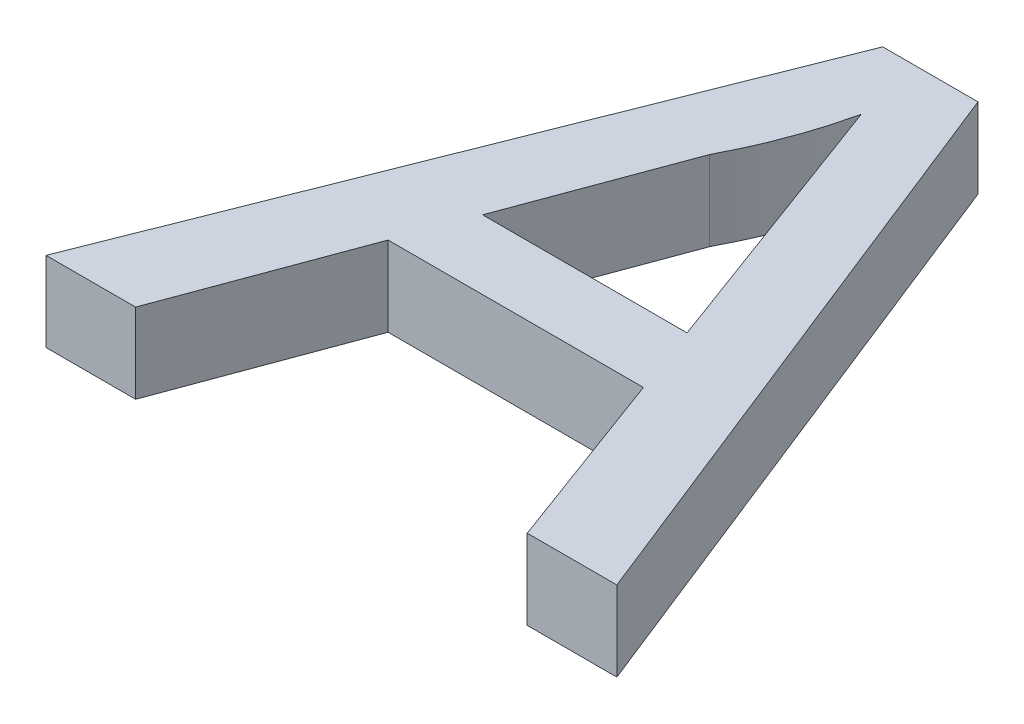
ISO-10303-21;
HEADER;
FILE_DESCRIPTION(('STEP AP214'),'2;1');
FILE_NAME('part.step','',(''),(''),'','','');
FILE_SCHEMA(('AUTOMOTIVE_DESIGN { 1 0 10303 214 1 1 1 1 }'));
ENDSEC;
DATA;
#1=APPLICATION_CONTEXT('core data for automotive mechanical design processes');
#2=APPLICATION_PROTOCOL_DEFINITION('international standard','automotive_design',2000,#1);
#3=PRODUCT_CONTEXT('',#1,'mechanical');
#4=PRODUCT('Part','Part','',(#3));
#5=PRODUCT_RELATED_PRODUCT_CATEGORY('part','',(#4));
#6=PRODUCT_DEFINITION_FORMATION('','',#4);
#7=PRODUCT_DEFINITION_CONTEXT('part definition',#1,'design');
#8=PRODUCT_DEFINITION('design','',#6,#7);
#9=PRODUCT_DEFINITION_SHAPE('','',#8);
#10=(LENGTH_UNIT() NAMED_UNIT(*) SI_UNIT(.MILLI.,.METRE.));
#11=(NAMED_UNIT(*) PLANE_ANGLE_UNIT() SI_UNIT($,.RADIAN.));
#12=(NAMED_UNIT(*) SI_UNIT($,.STERADIAN.) SOLID_ANGLE_UNIT());
#13=UNCERTAINTY_MEASURE_WITH_UNIT(LENGTH_MEASURE(1.E-05),#10,'distance_accuracy_value','');
#14=(GEOMETRIC_REPRESENTATION_CONTEXT(3) GLOBAL_UNCERTAINTY_ASSIGNED_CONTEXT((#13)) GLOBAL_UNIT_ASSIGNED_CONTEXT((#10,
#11,#12)) REPRESENTATION_CONTEXT('',''));
#15=CARTESIAN_POINT('',(0.,0.,0.));
#16=DIRECTION('',(0.,0.,1.));
#17=DIRECTION('',(1.,0.,0.));
#18=AXIS2_PLACEMENT_3D('',#15,#16,#17);
#19=CARTESIAN_POINT('',(0.703822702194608,6.60004762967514,-3.46452656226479));
#20=CARTESIAN_POINT('',(0.703822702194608,6.40004762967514,-3.46452656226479));
#21=CARTESIAN_POINT('',(0.698085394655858,6.60004762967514,-3.44078170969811));
#22=CARTESIAN_POINT('',(0.698085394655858,6.40004762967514,-3.44078170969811));
#23=CARTESIAN_POINT('',(0.686587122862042,6.60004762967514,-3.39319409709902));
#24=CARTESIAN_POINT('',(0.686587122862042,6.40004762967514,-3.39319409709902));
#25=CARTESIAN_POINT('',(0.662512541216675,6.60004762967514,-3.32347186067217));
#26=CARTESIAN_POINT('',(0.662512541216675,6.40004762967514,-3.32347186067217));
#27=CARTESIAN_POINT('',(0.634972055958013,6.60004762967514,-3.25438726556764));
#28=CARTESIAN_POINT('',(0.634972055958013,6.40004762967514,-3.25438726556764));
#29=CARTESIAN_POINT('',(0.612605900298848,6.60004762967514,-3.20986962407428));
#30=CARTESIAN_POINT('',(0.612605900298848,6.40004762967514,-3.20986962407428));
#31=CARTESIAN_POINT('',(0.601358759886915,6.60004762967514,-3.18748329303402));
#32=CARTESIAN_POINT('',(0.601358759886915,6.40004762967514,-3.18748329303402));
#33=(BOUNDED_SURFACE() B_SPLINE_SURFACE(3,1,((#19,#20),(#21,#22),(#23,#24),(#25,#26),(#27,#28),
(#29,#30),(#31,#32)),.UNSPECIFIED.,.F.,.F.,.F.) B_SPLINE_SURFACE_WITH_KNOTS((4,1,1,1,4),(2,2),
(0.,0.247294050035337,0.495607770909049,0.746359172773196,1.),(0.,1.),
.UNSPECIFIED.) GEOMETRIC_REPRESENTATION_ITEM() RATIONAL_B_SPLINE_SURFACE(((1.,1.),(1.,1.),(1.,
1.),(1.,1.),(1.,1.),(1.,1.),(1.,1.))) REPRESENTATION_ITEM('') SURFACE());
#34=CARTESIAN_POINT('',(0.703822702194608,6.40004762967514,-3.46452656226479));
#35=CARTESIAN_POINT('',(0.698085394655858,6.40004762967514,-3.44078170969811));
#36=CARTESIAN_POINT('',(0.686587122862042,6.40004762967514,-3.39319409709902));
#37=CARTESIAN_POINT('',(0.662512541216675,6.40004762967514,-3.32347186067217));
#38=CARTESIAN_POINT('',(0.634972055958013,6.40004762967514,-3.25438726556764));
#39=CARTESIAN_POINT('',(0.612605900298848,6.40004762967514,-3.20986962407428));
#40=CARTESIAN_POINT('',(0.601358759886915,6.40004762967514,-3.18748329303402));
#41=(BOUNDED_CURVE() B_SPLINE_CURVE(3,(#34,#35,#36,#37,#38,#39,#40),.UNSPECIFIED.,.F.,
.F.) B_SPLINE_CURVE_WITH_KNOTS((4,1,1,1,4),(0.,0.247294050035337,0.495607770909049,
0.746359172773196,1.),
.UNSPECIFIED.) CURVE() GEOMETRIC_REPRESENTATION_ITEM() RATIONAL_B_SPLINE_CURVE((1.,1.,1.,1.,1.,
1.,1.)) REPRESENTATION_ITEM(''));
#42=CARTESIAN_POINT('',(0.703822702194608,6.40004762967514,-3.46452656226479));
#43=VERTEX_POINT('',#42);
#44=CARTESIAN_POINT('',(0.601358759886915,6.40004762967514,-3.18748329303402));
#45=VERTEX_POINT('',#44);
#46=EDGE_CURVE('E152',#43,#45,#41,.T.);
#47=DIRECTION('',(0.,-1.,0.));
#48=VECTOR('',#47,1.);
#49=CARTESIAN_POINT('',(0.703822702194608,6.60004762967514,-3.46452656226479));
#50=LINE('',#49,#48);
#51=CARTESIAN_POINT('',(0.703822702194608,6.60004762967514,-3.46452656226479));
#52=VERTEX_POINT('',#51);
#53=EDGE_CURVE('E10',#52,#43,#50,.T.);
#54=CARTESIAN_POINT('',(0.703822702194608,6.60004762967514,-3.46452656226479));
#55=CARTESIAN_POINT('',(0.698085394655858,6.60004762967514,-3.44078170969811));
#56=CARTESIAN_POINT('',(0.686587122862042,6.60004762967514,-3.39319409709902));
#57=CARTESIAN_POINT('',(0.662512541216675,6.60004762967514,-3.32347186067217));
#58=CARTESIAN_POINT('',(0.634972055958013,6.60004762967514,-3.25438726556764));
#59=CARTESIAN_POINT('',(0.612605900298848,6.60004762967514,-3.20986962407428));
#60=CARTESIAN_POINT('',(0.601358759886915,6.60004762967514,-3.18748329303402));
#61=(BOUNDED_CURVE() B_SPLINE_CURVE(3,(#54,#55,#56,#57,#58,#59,#60),.UNSPECIFIED.,.F.,
.F.) B_SPLINE_CURVE_WITH_KNOTS((4,1,1,1,4),(0.,0.247294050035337,0.495607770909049,
0.746359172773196,1.),
.UNSPECIFIED.) CURVE() GEOMETRIC_REPRESENTATION_ITEM() RATIONAL_B_SPLINE_CURVE((1.,1.,1.,1.,1.,
1.,1.)) REPRESENTATION_ITEM(''));
#62=CARTESIAN_POINT('',(0.601358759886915,6.60004762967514,-3.18748329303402));
#63=VERTEX_POINT('',#62);
#64=EDGE_CURVE('E227',#52,#63,#61,.T.);
#65=DIRECTION('',(0.,-1.,0.));
#66=VECTOR('',#65,1.);
#67=CARTESIAN_POINT('',(0.601358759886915,6.60004762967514,-3.18748329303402));
#68=LINE('',#67,#66);
#69=EDGE_CURVE('E301',#63,#45,#68,.T.);
#70=ORIENTED_EDGE('',*,*,#46,.F.);
#71=ORIENTED_EDGE('',*,*,#53,.F.);
#72=ORIENTED_EDGE('',*,*,#64,.T.);
#73=ORIENTED_EDGE('',*,*,#69,.T.);
#74=EDGE_LOOP('',(#70,#71,#72,#73));
#75=FACE_BOUND('',#74,.T.);
#76=ADVANCED_FACE('F15',(#75),#33,.T.);
#77=CARTESIAN_POINT('',(0.8140991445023,6.60004762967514,-3.16644963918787));
#78=CARTESIAN_POINT('',(0.8140991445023,6.40004762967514,-3.16644963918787));
#79=CARTESIAN_POINT('',(0.804978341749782,6.60004762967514,-3.19131732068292));
#80=CARTESIAN_POINT('',(0.804978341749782,6.40004762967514,-3.19131732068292));
#81=CARTESIAN_POINT('',(0.795759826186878,6.60004762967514,-3.21614915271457));
#82=CARTESIAN_POINT('',(0.795759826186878,6.40004762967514,-3.21614915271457));
#83=CARTESIAN_POINT('',(0.786510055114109,6.60004762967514,-3.2409691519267));
#84=CARTESIAN_POINT('',(0.786510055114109,6.40004762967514,-3.2409691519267));
#85=CARTESIAN_POINT('',(0.777260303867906,6.60004762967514,-3.26578909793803));
#86=CARTESIAN_POINT('',(0.777260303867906,6.40004762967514,-3.26578909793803));
#87=CARTESIAN_POINT('',(0.768258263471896,6.60004762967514,-3.2907013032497));
#88=CARTESIAN_POINT('',(0.768258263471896,6.40004762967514,-3.2907013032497));
#89=CARTESIAN_POINT('',(0.758926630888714,6.60004762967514,-3.31549058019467));
#90=CARTESIAN_POINT('',(0.758926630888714,6.40004762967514,-3.31549058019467));
#91=CARTESIAN_POINT('',(0.740266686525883,6.60004762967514,-3.36506031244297));
#92=CARTESIAN_POINT('',(0.740266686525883,6.40004762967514,-3.36506031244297));
#93=CARTESIAN_POINT('',(0.721771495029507,6.60004762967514,-3.41469491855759));
#94=CARTESIAN_POINT('',(0.721771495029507,6.40004762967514,-3.41469491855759));
#95=CARTESIAN_POINT('',(0.703822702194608,6.60004762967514,-3.46452656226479));
#96=CARTESIAN_POINT('',(0.703822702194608,6.40004762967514,-3.46452656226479));
#97=(BOUNDED_SURFACE() B_SPLINE_SURFACE(3,1,((#77,#78),(#79,#80),(#81,#82),(#83,#84),(#85,#86),
(#87,#88),(#89,#90),(#91,#92),(#93,#94),(#95,#96)),.UNSPECIFIED.,.F.,.F.,
.F.) B_SPLINE_SURFACE_WITH_KNOTS((4,3,3,4),(2,2),(0.,0.250022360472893,0.50004422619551,1.),(0.,
1.),.UNSPECIFIED.) GEOMETRIC_REPRESENTATION_ITEM() RATIONAL_B_SPLINE_SURFACE(((1.,1.),(1.,1.),
(1.,1.),(1.,1.),(1.,1.),(1.,1.),(1.,1.),(1.,1.),(1.,1.),(1.,1.))) REPRESENTATION_ITEM('') SURFACE());
#98=CARTESIAN_POINT('',(0.8140991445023,6.40004762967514,-3.16644963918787));
#99=CARTESIAN_POINT('',(0.804978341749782,6.40004762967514,-3.19131732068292));
#100=CARTESIAN_POINT('',(0.795759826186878,6.40004762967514,-3.21614915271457));
#101=CARTESIAN_POINT('',(0.786510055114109,6.40004762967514,-3.2409691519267));
#102=CARTESIAN_POINT('',(0.777260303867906,6.40004762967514,-3.26578909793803));
#103=CARTESIAN_POINT('',(0.768258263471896,6.40004762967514,-3.2907013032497));
#104=CARTESIAN_POINT('',(0.758926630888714,6.40004762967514,-3.31549058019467));
#105=CARTESIAN_POINT('',(0.740266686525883,6.40004762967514,-3.36506031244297));
#106=CARTESIAN_POINT('',(0.721771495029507,6.40004762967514,-3.41469491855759));
#107=CARTESIAN_POINT('',(0.703822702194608,6.40004762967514,-3.46452656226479));
#108=(BOUNDED_CURVE() B_SPLINE_CURVE(3,(#98,#99,#100,#101,#102,#103,#104,#105,#106,#107),
.UNSPECIFIED.,.F.,.F.) B_SPLINE_CURVE_WITH_KNOTS((4,3,3,4),(0.,0.250022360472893,
0.50004422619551,1.),
.UNSPECIFIED.) CURVE() GEOMETRIC_REPRESENTATION_ITEM() RATIONAL_B_SPLINE_CURVE((1.,1.,1.,1.,1.,
1.,1.,1.,1.,1.)) REPRESENTATION_ITEM(''));
#109=CARTESIAN_POINT('',(0.8140991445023,6.40004762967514,-3.16644963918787));
#110=VERTEX_POINT('',#109);
#111=EDGE_CURVE('E270',#110,#43,#108,.T.);
#112=DIRECTION('',(0.,-1.,0.));
#113=VECTOR('',#112,1.);
#114=CARTESIAN_POINT('',(0.8140991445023,6.60004762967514,-3.16644963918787));
#115=LINE('',#114,#113);
#116=CARTESIAN_POINT('',(0.8140991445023,6.60004762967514,-3.16644963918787));
#117=VERTEX_POINT('',#116);
#118=EDGE_CURVE('E25',#117,#110,#115,.T.);
#119=CARTESIAN_POINT('',(0.8140991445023,6.60004762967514,-3.16644963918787));
#120=CARTESIAN_POINT('',(0.804978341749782,6.60004762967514,-3.19131732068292));
#121=CARTESIAN_POINT('',(0.795759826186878,6.60004762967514,-3.21614915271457));
#122=CARTESIAN_POINT('',(0.786510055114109,6.60004762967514,-3.2409691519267));
#123=CARTESIAN_POINT('',(0.777260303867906,6.60004762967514,-3.26578909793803));
#124=CARTESIAN_POINT('',(0.768258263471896,6.60004762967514,-3.2907013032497));
#125=CARTESIAN_POINT('',(0.758926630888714,6.60004762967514,-3.31549058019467));
#126=CARTESIAN_POINT('',(0.740266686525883,6.60004762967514,-3.36506031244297));
#127=CARTESIAN_POINT('',(0.721771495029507,6.60004762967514,-3.41469491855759));
#128=CARTESIAN_POINT('',(0.703822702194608,6.60004762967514,-3.46452656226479));
#129=(BOUNDED_CURVE() B_SPLINE_CURVE(3,(#119,#120,#121,#122,#123,#124,#125,#126,#127,#128),
.UNSPECIFIED.,.F.,.F.) B_SPLINE_CURVE_WITH_KNOTS((4,3,3,4),(0.,0.250022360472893,
0.50004422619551,1.),
.UNSPECIFIED.) CURVE() GEOMETRIC_REPRESENTATION_ITEM() RATIONAL_B_SPLINE_CURVE((1.,1.,1.,1.,1.,
1.,1.,1.,1.,1.)) REPRESENTATION_ITEM(''));
#130=EDGE_CURVE('E233',#117,#52,#129,.T.);
#131=ORIENTED_EDGE('',*,*,#111,.F.);
#132=ORIENTED_EDGE('',*,*,#118,.F.);
#133=ORIENTED_EDGE('',*,*,#130,.T.);
#134=ORIENTED_EDGE('',*,*,#53,.T.);
#135=EDGE_LOOP('',(#131,#132,#133,#134));
#136=FACE_BOUND('',#135,.T.);
#137=ADVANCED_FACE('F434',(#136),#97,.T.);
#138=CARTESIAN_POINT('',(1.74602577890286,6.60004762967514,-0.645443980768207));
#139=DIRECTION('',(-0.937964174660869,0.,0.346732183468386));
#140=DIRECTION('',(0.,1.,0.));
#141=AXIS2_PLACEMENT_3D('',#138,#139,#140);
#142=PLANE('',#141);
#143=DIRECTION('',(-0.346732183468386,0.,-0.937964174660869));
#144=VECTOR('',#143,1.);
#145=CARTESIAN_POINT('',(1.74602577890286,6.40004762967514,-0.645443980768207));
#146=LINE('',#145,#144);
#147=CARTESIAN_POINT('',(0.959832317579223,6.40004762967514,-2.77221886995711));
#148=VERTEX_POINT('',#147);
#149=EDGE_CURVE('E266',#148,#110,#146,.T.);
#150=ORIENTED_EDGE('',*,*,#149,.F.);
#151=DIRECTION('',(0.,-1.,0.));
#152=VECTOR('',#151,1.);
#153=CARTESIAN_POINT('',(0.959832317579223,6.60004762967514,-2.77221886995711));
#154=LINE('',#153,#152);
#155=CARTESIAN_POINT('',(0.959832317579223,6.60004762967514,-2.77221886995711));
#156=VERTEX_POINT('',#155);
#157=EDGE_CURVE('E304',#156,#148,#154,.T.);
#158=ORIENTED_EDGE('',*,*,#157,.F.);
#159=DIRECTION('',(-0.346732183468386,0.,-0.937964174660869));
#160=VECTOR('',#159,1.);
#161=CARTESIAN_POINT('',(1.74602577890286,6.60004762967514,-0.645443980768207));
#162=LINE('',#161,#160);
#163=EDGE_CURVE('E241',#156,#117,#162,.T.);
#164=ORIENTED_EDGE('',*,*,#163,.T.);
#165=ORIENTED_EDGE('',*,*,#118,.T.);
#166=EDGE_LOOP('',(#150,#158,#164,#165));
#167=FACE_BOUND('',#166,.T.);
#168=ADVANCED_FACE('F354',(#167),#142,.T.);
#169=CARTESIAN_POINT('',(0.,6.60004762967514,-2.7722188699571));
#170=DIRECTION('',(0.,0.,-1.));
#171=DIRECTION('',(0.,-1.,0.));
#172=AXIS2_PLACEMENT_3D('',#169,#170,#171);
#173=PLANE('',#172);
#174=DIRECTION('',(1.,0.,0.));
#175=VECTOR('',#174,1.);
#176=CARTESIAN_POINT('',(0.,6.40004762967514,-2.7722188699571));
#177=LINE('',#176,#175);
#178=CARTESIAN_POINT('',(0.447813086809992,6.40004762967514,-2.7722188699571));
#179=VERTEX_POINT('',#178);
#180=EDGE_CURVE('E262',#179,#148,#177,.T.);
#181=ORIENTED_EDGE('',*,*,#180,.F.);
#182=DIRECTION('',(0.,-1.,0.));
#183=VECTOR('',#182,1.);
#184=CARTESIAN_POINT('',(0.447813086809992,6.60004762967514,-2.7722188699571));
#185=LINE('',#184,#183);
#186=CARTESIAN_POINT('',(0.447813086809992,6.60004762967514,-2.7722188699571));
#187=VERTEX_POINT('',#186);
#188=EDGE_CURVE('E176',#187,#179,#185,.T.);
#189=ORIENTED_EDGE('',*,*,#188,.F.);
#190=DIRECTION('',(1.,0.,0.));
#191=VECTOR('',#190,1.);
#192=CARTESIAN_POINT('',(0.,6.60004762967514,-2.7722188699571));
#193=LINE('',#192,#191);
#194=EDGE_CURVE('E213',#187,#156,#193,.T.);
#195=ORIENTED_EDGE('',*,*,#194,.T.);
#196=ORIENTED_EDGE('',*,*,#157,.T.);
#197=EDGE_LOOP('',(#181,#189,#195,#196));
#198=FACE_BOUND('',#197,.T.);
#199=ADVANCED_FACE('F348',(#198),#173,.T.);
#200=CARTESIAN_POINT('',(-0.507800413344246,6.60004762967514,-0.187761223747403));
#201=DIRECTION('',(0.93793691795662,0.,0.346805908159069));
#202=DIRECTION('',(0.,-1.,0.));
#203=AXIS2_PLACEMENT_3D('',#200,#201,#202);
#204=PLANE('',#203);
#205=DIRECTION('',(-0.346805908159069,0.,0.93793691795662));
#206=VECTOR('',#205,1.);
#207=CARTESIAN_POINT('',(-0.507800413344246,6.40004762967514,-0.187761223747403));
#208=LINE('',#207,#206);
#209=EDGE_CURVE('E179',#45,#179,#208,.T.);
#210=ORIENTED_EDGE('',*,*,#209,.F.);
#211=ORIENTED_EDGE('',*,*,#69,.F.);
#212=DIRECTION('',(-0.346805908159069,0.,0.93793691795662));
#213=VECTOR('',#212,1.);
#214=CARTESIAN_POINT('',(-0.507800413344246,6.60004762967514,-0.187761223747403));
#215=LINE('',#214,#213);
#216=EDGE_CURVE('E223',#63,#187,#215,.T.);
#217=ORIENTED_EDGE('',*,*,#216,.T.);
#218=ORIENTED_EDGE('',*,*,#188,.T.);
#219=EDGE_LOOP('',(#210,#211,#217,#218));
#220=FACE_BOUND('',#219,.T.);
#221=ADVANCED_FACE('F353',(#220),#204,.T.);
#222=CARTESIAN_POINT('',(0.,6.60004762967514,-2.59914194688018));
#223=DIRECTION('',(0.,0.,1.));
#224=DIRECTION('',(1.,0.,0.));
#225=AXIS2_PLACEMENT_3D('',#222,#223,#224);
#226=PLANE('',#225);
#227=DIRECTION('',(-1.,0.,0.));
#228=VECTOR('',#227,1.);
#229=CARTESIAN_POINT('',(0.,6.40004762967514,-2.59914194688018));
#230=LINE('',#229,#228);
#231=CARTESIAN_POINT('',(1.02353424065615,6.40004762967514,-2.59914194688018));
#232=VERTEX_POINT('',#231);
#233=CARTESIAN_POINT('',(0.384111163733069,6.40004762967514,-2.59914194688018));
#234=VERTEX_POINT('',#233);
#235=EDGE_CURVE('E192',#232,#234,#230,.T.);
#236=ORIENTED_EDGE('',*,*,#235,.F.);
#237=DIRECTION('',(0.,-1.,0.));
#238=VECTOR('',#237,1.);
#239=CARTESIAN_POINT('',(1.02353424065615,6.60004762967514,-2.59914194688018));
#240=LINE('',#239,#238);
#241=CARTESIAN_POINT('',(1.02353424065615,6.60004762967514,-2.59914194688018));
#242=VERTEX_POINT('',#241);
#243=EDGE_CURVE('E151',#242,#232,#240,.T.);
#244=ORIENTED_EDGE('',*,*,#243,.F.);
#245=DIRECTION('',(-1.,0.,0.));
#246=VECTOR('',#245,1.);
#247=CARTESIAN_POINT('',(0.,6.60004762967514,-2.59914194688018));
#248=LINE('',#247,#246);
#249=CARTESIAN_POINT('',(0.384111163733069,6.60004762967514,-2.59914194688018));
#250=VERTEX_POINT('',#249);
#251=EDGE_CURVE('E168',#242,#250,#248,.T.);
#252=ORIENTED_EDGE('',*,*,#251,.T.);
#253=DIRECTION('',(0.,-1.,0.));
#254=VECTOR('',#253,1.);
#255=CARTESIAN_POINT('',(0.384111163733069,6.60004762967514,-2.59914194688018));
#256=LINE('',#255,#254);
#257=EDGE_CURVE('E298',#250,#234,#256,.T.);
#258=ORIENTED_EDGE('',*,*,#257,.T.);
#259=EDGE_LOOP('',(#236,#244,#252,#258));
#260=FACE_BOUND('',#259,.T.);
#261=ADVANCED_FACE('F319',(#260),#226,.T.);
#262=CARTESIAN_POINT('',(-0.507615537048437,6.60004762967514,-0.187711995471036));
#263=DIRECTION('',(0.937925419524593,0.,0.346837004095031));
#264=DIRECTION('',(0.,-1.,0.));
#265=AXIS2_PLACEMENT_3D('',#262,#263,#264);
#266=PLANE('',#265);
#267=DIRECTION('',(-0.346837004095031,0.,0.937925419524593));
#268=VECTOR('',#267,1.);
#269=CARTESIAN_POINT('',(-0.507615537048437,6.40004762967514,-0.187711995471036));
#270=LINE('',#269,#268);
#271=CARTESIAN_POINT('',(0.213438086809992,6.40004762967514,-2.13760348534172));
#272=VERTEX_POINT('',#271);
#273=EDGE_CURVE('E187',#234,#272,#270,.T.);
#274=ORIENTED_EDGE('',*,*,#273,.F.);
#275=ORIENTED_EDGE('',*,*,#257,.F.);
#276=DIRECTION('',(-0.346837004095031,0.,0.937925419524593));
#277=VECTOR('',#276,1.);
#278=CARTESIAN_POINT('',(-0.507615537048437,6.60004762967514,-0.187711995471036));
#279=LINE('',#278,#277);
#280=CARTESIAN_POINT('',(0.213438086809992,6.60004762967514,-2.13760348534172));
#281=VERTEX_POINT('',#280);
#282=EDGE_CURVE('E184',#250,#281,#279,.T.);
#283=ORIENTED_EDGE('',*,*,#282,.T.);
#284=DIRECTION('',(0.,-1.,0.));
#285=VECTOR('',#284,1.);
#286=CARTESIAN_POINT('',(0.213438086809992,6.60004762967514,-2.13760348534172));
#287=LINE('',#286,#285);
#288=EDGE_CURVE('E295',#281,#272,#287,.T.);
#289=ORIENTED_EDGE('',*,*,#288,.T.);
#290=EDGE_LOOP('',(#274,#275,#283,#289));
#291=FACE_BOUND('',#290,.T.);
#292=ADVANCED_FACE('F313',(#291),#266,.T.);
#293=CARTESIAN_POINT('',(0.,6.60004762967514,-2.13760348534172));
#294=DIRECTION('',(0.,0.,1.));
#295=DIRECTION('',(1.,0.,0.));
#296=AXIS2_PLACEMENT_3D('',#293,#294,#295);
#297=PLANE('',#296);
#298=DIRECTION('',(-1.,0.,0.));
#299=VECTOR('',#298,1.);
#300=CARTESIAN_POINT('',(0.,6.40004762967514,-2.13760348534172));
#301=LINE('',#300,#299);
#302=CARTESIAN_POINT('',(-0.0110210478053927,6.40004762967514,-2.13760348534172));
#303=VERTEX_POINT('',#302);
#304=EDGE_CURVE('E191',#272,#303,#301,.T.);
#305=ORIENTED_EDGE('',*,*,#304,.F.);
#306=ORIENTED_EDGE('',*,*,#288,.F.);
#307=DIRECTION('',(-1.,0.,0.));
#308=VECTOR('',#307,1.);
#309=CARTESIAN_POINT('',(0.,6.60004762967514,-2.13760348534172));
#310=LINE('',#309,#308);
#311=CARTESIAN_POINT('',(-0.0110210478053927,6.60004762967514,-2.13760348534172));
#312=VERTEX_POINT('',#311);
#313=EDGE_CURVE('E181',#281,#312,#310,.T.);
#314=ORIENTED_EDGE('',*,*,#313,.T.);
#315=DIRECTION('',(0.,-1.,0.));
#316=VECTOR('',#315,1.);
#317=CARTESIAN_POINT('',(-0.0110210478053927,6.60004762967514,-2.13760348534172));
#318=LINE('',#317,#316);
#319=EDGE_CURVE('E196',#312,#303,#318,.T.);
#320=ORIENTED_EDGE('',*,*,#319,.T.);
#321=EDGE_LOOP('',(#305,#306,#314,#320));
#322=FACE_BOUND('',#321,.T.);
#323=ADVANCED_FACE('F318',(#322),#297,.T.);
#324=CARTESIAN_POINT('',(-0.742655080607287,6.60004762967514,-0.294860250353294));
#325=DIRECTION('',(-0.929423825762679,0.,-0.369014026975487));
#326=DIRECTION('',(-0.369014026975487,0.,0.929423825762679));
#327=AXIS2_PLACEMENT_3D('',#324,#325,#326);
#328=PLANE('',#327);
#329=DIRECTION('',(0.369014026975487,0.,-0.929423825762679));
#330=VECTOR('',#329,1.);
#331=CARTESIAN_POINT('',(-0.742655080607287,6.40004762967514,-0.294860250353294));
#332=LINE('',#331,#330);
#333=CARTESIAN_POINT('',(0.584531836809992,6.40004762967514,-3.63760348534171));
#334=VERTEX_POINT('',#333);
#335=EDGE_CURVE('E252',#303,#334,#332,.T.);
#336=ORIENTED_EDGE('',*,*,#335,.F.);
#337=ORIENTED_EDGE('',*,*,#319,.F.);
#338=DIRECTION('',(0.369014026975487,0.,-0.929423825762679));
#339=VECTOR('',#338,1.);
#340=CARTESIAN_POINT('',(-0.742655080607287,6.60004762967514,-0.294860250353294));
#341=LINE('',#340,#339);
#342=CARTESIAN_POINT('',(0.584531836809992,6.60004762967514,-3.63760348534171));
#343=VERTEX_POINT('',#342);
#344=EDGE_CURVE('E185',#312,#343,#341,.T.);
#345=ORIENTED_EDGE('',*,*,#344,.T.);
#346=DIRECTION('',(0.,-1.,0.));
#347=VECTOR('',#346,1.);
#348=CARTESIAN_POINT('',(0.584531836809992,6.60004762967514,-3.63760348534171));
#349=LINE('',#348,#347);
#350=EDGE_CURVE('E193',#343,#334,#349,.T.);
#351=ORIENTED_EDGE('',*,*,#350,.T.);
#352=EDGE_LOOP('',(#336,#337,#345,#351));
#353=FACE_BOUND('',#352,.T.);
#354=ADVANCED_FACE('F400',(#353),#328,.T.);
#355=CARTESIAN_POINT('',(0.,6.60004762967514,-3.63760348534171));
#356=DIRECTION('',(0.,0.,-1.));
#357=DIRECTION('',(0.,-1.,0.));
#358=AXIS2_PLACEMENT_3D('',#355,#356,#357);
#359=PLANE('',#358);
#360=DIRECTION('',(1.,0.,0.));
#361=VECTOR('',#360,1.);
#362=CARTESIAN_POINT('',(0.,6.40004762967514,-3.63760348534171));
#363=LINE('',#362,#361);
#364=CARTESIAN_POINT('',(0.823113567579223,6.40004762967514,-3.63760348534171));
#365=VERTEX_POINT('',#364);
#366=EDGE_CURVE('E204',#334,#365,#363,.T.);
#367=ORIENTED_EDGE('',*,*,#366,.F.);
#368=ORIENTED_EDGE('',*,*,#350,.F.);
#369=DIRECTION('',(1.,0.,0.));
#370=VECTOR('',#369,1.);
#371=CARTESIAN_POINT('',(0.,6.60004762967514,-3.63760348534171));
#372=LINE('',#371,#370);
#373=CARTESIAN_POINT('',(0.823113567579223,6.60004762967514,-3.63760348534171));
#374=VERTEX_POINT('',#373);
#375=EDGE_CURVE('E207',#343,#374,#372,.T.);
#376=ORIENTED_EDGE('',*,*,#375,.T.);
#377=DIRECTION('',(0.,-1.,0.));
#378=VECTOR('',#377,1.);
#379=CARTESIAN_POINT('',(0.823113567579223,6.60004762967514,-3.63760348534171));
#380=LINE('',#379,#378);
#381=EDGE_CURVE('E197',#374,#365,#380,.T.);
#382=ORIENTED_EDGE('',*,*,#381,.T.);
#383=EDGE_LOOP('',(#367,#368,#376,#382));
#384=FACE_BOUND('',#383,.T.);
#385=ADVANCED_FACE('F390',(#384),#359,.T.);
#386=CARTESIAN_POINT('',(1.95861950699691,6.60004762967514,-0.777640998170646));
#387=DIRECTION('',(0.929423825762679,0.,-0.369014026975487));
#388=DIRECTION('',(0.,-1.,0.));
#389=AXIS2_PLACEMENT_3D('',#386,#387,#388);
#390=PLANE('',#389);
#391=DIRECTION('',(0.369014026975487,0.,0.929423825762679));
#392=VECTOR('',#391,1.);
#393=CARTESIAN_POINT('',(1.95861950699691,6.40004762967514,-0.777640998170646));
#394=LINE('',#393,#392);
#395=CARTESIAN_POINT('',(1.41866645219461,6.40004762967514,-2.13760348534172));
#396=VERTEX_POINT('',#395);
#397=EDGE_CURVE('E180',#365,#396,#394,.T.);
#398=ORIENTED_EDGE('',*,*,#397,.F.);
#399=ORIENTED_EDGE('',*,*,#381,.F.);
#400=DIRECTION('',(0.369014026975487,0.,0.929423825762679));
#401=VECTOR('',#400,1.);
#402=CARTESIAN_POINT('',(1.95861950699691,6.60004762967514,-0.777640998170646));
#403=LINE('',#402,#401);
#404=CARTESIAN_POINT('',(1.41866645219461,6.60004762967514,-2.13760348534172));
#405=VERTEX_POINT('',#404);
#406=EDGE_CURVE('E162',#374,#405,#403,.T.);
#407=ORIENTED_EDGE('',*,*,#406,.T.);
#408=DIRECTION('',(0.,-1.,0.));
#409=VECTOR('',#408,1.);
#410=CARTESIAN_POINT('',(1.41866645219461,6.60004762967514,-2.13760348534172));
#411=LINE('',#410,#409);
#412=EDGE_CURVE('E157',#405,#396,#411,.T.);
#413=ORIENTED_EDGE('',*,*,#412,.T.);
#414=EDGE_LOOP('',(#398,#399,#407,#413));
#415=FACE_BOUND('',#414,.T.);
#416=ADVANCED_FACE('F381',(#415),#390,.T.);
#417=CARTESIAN_POINT('',(0.,6.60004762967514,-2.13760348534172));
#418=DIRECTION('',(0.,0.,1.));
#419=DIRECTION('',(1.,0.,0.));
#420=AXIS2_PLACEMENT_3D('',#417,#418,#419);
#421=PLANE('',#420);
#422=DIRECTION('',(-1.,0.,0.));
#423=VECTOR('',#422,1.);
#424=CARTESIAN_POINT('',(0.,6.40004762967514,-2.13760348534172));
#425=LINE('',#424,#423);
#426=CARTESIAN_POINT('',(1.19420731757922,6.40004762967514,-2.13760348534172));
#427=VERTEX_POINT('',#426);
#428=EDGE_CURVE('E177',#396,#427,#425,.T.);
#429=ORIENTED_EDGE('',*,*,#428,.F.);
#430=ORIENTED_EDGE('',*,*,#412,.F.);
#431=DIRECTION('',(-1.,0.,0.));
#432=VECTOR('',#431,1.);
#433=CARTESIAN_POINT('',(0.,6.60004762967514,-2.13760348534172));
#434=LINE('',#433,#432);
#435=CARTESIAN_POINT('',(1.19420731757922,6.60004762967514,-2.13760348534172));
#436=VERTEX_POINT('',#435);
#437=EDGE_CURVE('E155',#405,#436,#434,.T.);
#438=ORIENTED_EDGE('',*,*,#437,.T.);
#439=DIRECTION('',(0.,-1.,0.));
#440=VECTOR('',#439,1.);
#441=CARTESIAN_POINT('',(1.19420731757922,6.60004762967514,-2.13760348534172));
#442=LINE('',#441,#440);
#443=EDGE_CURVE('E140',#436,#427,#442,.T.);
#444=ORIENTED_EDGE('',*,*,#443,.T.);
#445=EDGE_LOOP('',(#429,#430,#438,#444));
#446=FACE_BOUND('',#445,.T.);
#447=ADVANCED_FACE('F156',(#446),#421,.T.);
#448=CARTESIAN_POINT('',(1.74592696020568,6.60004762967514,-0.645629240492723));
#449=DIRECTION('',(-0.937925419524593,0.,0.346837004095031));
#450=DIRECTION('',(0.,1.,0.));
#451=AXIS2_PLACEMENT_3D('',#448,#449,#450);
#452=PLANE('',#451);
#453=DIRECTION('',(-0.346837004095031,0.,-0.937925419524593));
#454=VECTOR('',#453,1.);
#455=CARTESIAN_POINT('',(1.74592696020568,6.40004762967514,-0.645629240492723));
#456=LINE('',#455,#454);
#457=EDGE_CURVE('E146',#427,#232,#456,.T.);
#458=ORIENTED_EDGE('',*,*,#457,.F.);
#459=ORIENTED_EDGE('',*,*,#443,.F.);
#460=DIRECTION('',(-0.346837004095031,0.,-0.937925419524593));
#461=VECTOR('',#460,1.);
#462=CARTESIAN_POINT('',(1.74592696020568,6.60004762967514,-0.645629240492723));
#463=LINE('',#462,#461);
#464=EDGE_CURVE('E144',#436,#242,#463,.T.);
#465=ORIENTED_EDGE('',*,*,#464,.T.);
#466=ORIENTED_EDGE('',*,*,#243,.T.);
#467=EDGE_LOOP('',(#458,#459,#465,#466));
#468=FACE_BOUND('',#467,.T.);
#469=ADVANCED_FACE('F142',(#468),#452,.T.);
#470=CARTESIAN_POINT('',(0.,6.40004762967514,0.));
#471=DIRECTION('',(0.,1.,0.));
#472=DIRECTION('',(1.,0.,0.));
#473=AXIS2_PLACEMENT_3D('',#470,#471,#472);
#474=PLANE('',#473);
#475=ORIENTED_EDGE('',*,*,#209,.T.);
#476=ORIENTED_EDGE('',*,*,#180,.T.);
#477=ORIENTED_EDGE('',*,*,#149,.T.);
#478=ORIENTED_EDGE('',*,*,#111,.T.);
#479=ORIENTED_EDGE('',*,*,#46,.T.);
#480=EDGE_LOOP('',(#475,#476,#477,#478,#479));
#481=FACE_BOUND('',#480,.T.);
#482=ORIENTED_EDGE('',*,*,#457,.T.);
#483=ORIENTED_EDGE('',*,*,#235,.T.);
#484=ORIENTED_EDGE('',*,*,#273,.T.);
#485=ORIENTED_EDGE('',*,*,#304,.T.);
#486=ORIENTED_EDGE('',*,*,#335,.T.);
#487=ORIENTED_EDGE('',*,*,#366,.T.);
#488=ORIENTED_EDGE('',*,*,#397,.T.);
#489=ORIENTED_EDGE('',*,*,#428,.T.);
#490=EDGE_LOOP('',(#482,#483,#484,#485,#486,#487,#488,#489));
#491=FACE_BOUND('',#490,.T.);
#492=ADVANCED_FACE('F332',(#481,#491),#474,.F.);
#493=CARTESIAN_POINT('',(0.,6.60004762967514,0.));
#494=DIRECTION('',(0.,1.,0.));
#495=DIRECTION('',(1.,0.,0.));
#496=AXIS2_PLACEMENT_3D('',#493,#494,#495);
#497=PLANE('',#496);
#498=ORIENTED_EDGE('',*,*,#194,.F.);
#499=ORIENTED_EDGE('',*,*,#216,.F.);
#500=ORIENTED_EDGE('',*,*,#64,.F.);
#501=ORIENTED_EDGE('',*,*,#130,.F.);
#502=ORIENTED_EDGE('',*,*,#163,.F.);
#503=EDGE_LOOP('',(#498,#499,#500,#501,#502));
#504=FACE_BOUND('',#503,.T.);
#505=ORIENTED_EDGE('',*,*,#464,.F.);
#506=ORIENTED_EDGE('',*,*,#437,.F.);
#507=ORIENTED_EDGE('',*,*,#406,.F.);
#508=ORIENTED_EDGE('',*,*,#375,.F.);
#509=ORIENTED_EDGE('',*,*,#344,.F.);
#510=ORIENTED_EDGE('',*,*,#313,.F.);
#511=ORIENTED_EDGE('',*,*,#282,.F.);
#512=ORIENTED_EDGE('',*,*,#251,.F.);
#513=EDGE_LOOP('',(#505,#506,#507,#508,#509,#510,#511,#512));
#514=FACE_BOUND('',#513,.T.);
#515=ADVANCED_FACE('F165',(#504,#514),#497,.T.);
#516=CLOSED_SHELL('',(#76,#137,#168,#199,#221,#261,#292,#323,#354,#385,#416,#447,#469,#492,#515));
#517=MANIFOLD_SOLID_BREP('B1',#516);
#518=ADVANCED_BREP_SHAPE_REPRESENTATION('',(#18,#517),#14);
#519=SHAPE_DEFINITION_REPRESENTATION(#9,#518);
ENDSEC;
END-ISO-10303-21;
